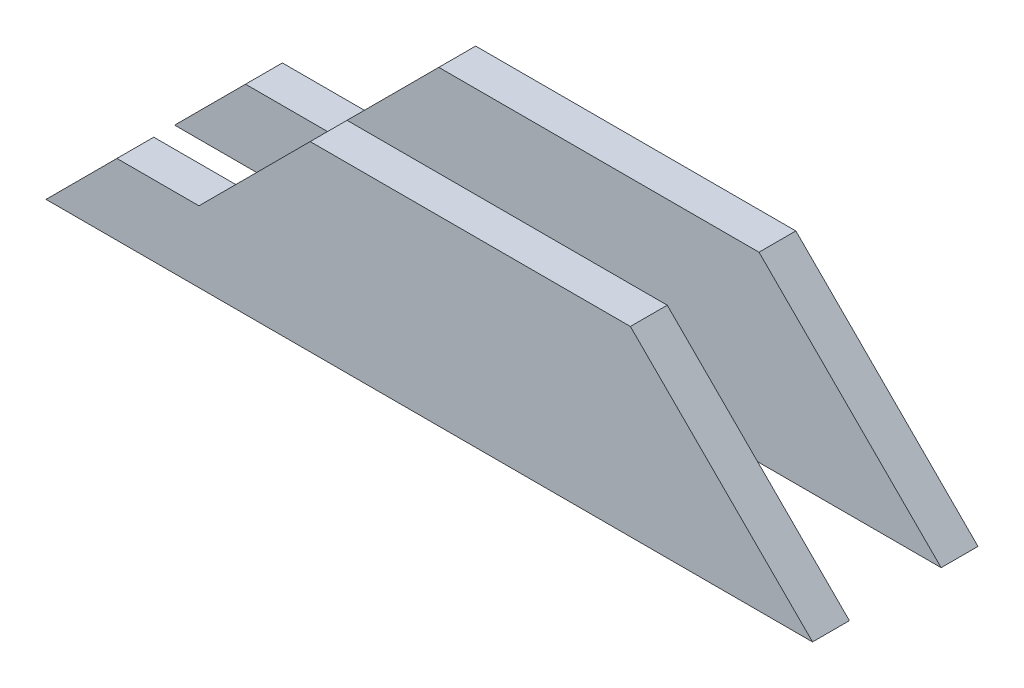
ISO-10303-21;
HEADER;
FILE_DESCRIPTION(('STEP AP214'),'2;1');
FILE_NAME('part.step','',(''),(''),'','','');
FILE_SCHEMA(('AUTOMOTIVE_DESIGN { 1 0 10303 214 1 1 1 1 }'));
ENDSEC;
DATA;
#1=APPLICATION_CONTEXT('core data for automotive mechanical design processes');
#2=APPLICATION_PROTOCOL_DEFINITION('international standard','automotive_design',2000,#1);
#3=PRODUCT_CONTEXT('',#1,'mechanical');
#4=PRODUCT('Part','Part','',(#3));
#5=PRODUCT_RELATED_PRODUCT_CATEGORY('part','',(#4));
#6=PRODUCT_DEFINITION_FORMATION('','',#4);
#7=PRODUCT_DEFINITION_CONTEXT('part definition',#1,'design');
#8=PRODUCT_DEFINITION('design','',#6,#7);
#9=PRODUCT_DEFINITION_SHAPE('','',#8);
#10=(LENGTH_UNIT() NAMED_UNIT(*) SI_UNIT(.MILLI.,.METRE.));
#11=(NAMED_UNIT(*) PLANE_ANGLE_UNIT() SI_UNIT($,.RADIAN.));
#12=(NAMED_UNIT(*) SI_UNIT($,.STERADIAN.) SOLID_ANGLE_UNIT());
#13=UNCERTAINTY_MEASURE_WITH_UNIT(LENGTH_MEASURE(1.E-05),#10,'distance_accuracy_value','');
#14=(GEOMETRIC_REPRESENTATION_CONTEXT(3) GLOBAL_UNCERTAINTY_ASSIGNED_CONTEXT((#13)) GLOBAL_UNIT_ASSIGNED_CONTEXT((#10,
#11,#12)) REPRESENTATION_CONTEXT('',''));
#15=CARTESIAN_POINT('',(0.,0.,0.));
#16=DIRECTION('',(0.,0.,1.));
#17=DIRECTION('',(1.,0.,0.));
#18=AXIS2_PLACEMENT_3D('',#15,#16,#17);
#19=CARTESIAN_POINT('',(-115.2652,12.954,15.113));
#20=DIRECTION('',(0.,1.,0.));
#21=DIRECTION('',(0.,0.,1.));
#22=AXIS2_PLACEMENT_3D('',#19,#20,#21);
#23=PLANE('',#22);
#24=DIRECTION('',(0.,0.,1.));
#25=VECTOR('',#24,1.);
#26=CARTESIAN_POINT('',(-102.3112,12.954,-15.11305));
#27=LINE('',#26,#25);
#28=CARTESIAN_POINT('',(-102.3112,12.954,-15.113));
#29=VERTEX_POINT('',#28);
#30=CARTESIAN_POINT('',(-102.3112,12.954,-8.382));
#31=VERTEX_POINT('',#30);
#32=EDGE_CURVE('E160',#29,#31,#27,.T.);
#33=ORIENTED_EDGE('',*,*,#32,.T.);
#34=DIRECTION('',(-1.,0.,0.));
#35=VECTOR('',#34,1.);
#36=CARTESIAN_POINT('',(-115.2652,12.954,-8.382));
#37=LINE('',#36,#35);
#38=CARTESIAN_POINT('',(-87.3252,12.954,-8.382));
#39=VERTEX_POINT('',#38);
#40=EDGE_CURVE('E53',#39,#31,#37,.T.);
#41=ORIENTED_EDGE('',*,*,#40,.F.);
#42=DIRECTION('',(0.,0.,-1.));
#43=VECTOR('',#42,1.);
#44=CARTESIAN_POINT('',(-87.3252,12.954,116.310275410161));
#45=LINE('',#44,#43);
#46=CARTESIAN_POINT('',(-87.3252,12.954,-15.113));
#47=VERTEX_POINT('',#46);
#48=EDGE_CURVE('E106',#39,#47,#45,.T.);
#49=ORIENTED_EDGE('',*,*,#48,.T.);
#50=DIRECTION('',(-1.,0.,0.));
#51=VECTOR('',#50,1.);
#52=CARTESIAN_POINT('',(-115.2652,12.954,-15.113));
#53=LINE('',#52,#51);
#54=EDGE_CURVE('E109',#47,#29,#53,.T.);
#55=ORIENTED_EDGE('',*,*,#54,.T.);
#56=EDGE_LOOP('',(#33,#41,#49,#55));
#57=FACE_BOUND('',#56,.T.);
#58=ADVANCED_FACE('F44',(#57),#23,.T.);
#59=CARTESIAN_POINT('',(-115.2652,0.,15.113));
#60=DIRECTION('',(0.,1.,0.));
#61=DIRECTION('',(0.,0.,1.));
#62=AXIS2_PLACEMENT_3D('',#59,#60,#61);
#63=PLANE('',#62);
#64=DIRECTION('',(0.,0.,-1.));
#65=VECTOR('',#64,1.);
#66=CARTESIAN_POINT('',(24.765,0.,-15.113));
#67=LINE('',#66,#65);
#68=CARTESIAN_POINT('',(24.765,0.,-8.382));
#69=VERTEX_POINT('',#68);
#70=CARTESIAN_POINT('',(24.765,0.,-15.113));
#71=VERTEX_POINT('',#70);
#72=EDGE_CURVE('E130',#69,#71,#67,.T.);
#73=ORIENTED_EDGE('',*,*,#72,.F.);
#74=DIRECTION('',(-1.,0.,0.));
#75=VECTOR('',#74,1.);
#76=CARTESIAN_POINT('',(-115.2652,0.,-8.382));
#77=LINE('',#76,#75);
#78=CARTESIAN_POINT('',(-115.2652,0.,-8.382));
#79=VERTEX_POINT('',#78);
#80=EDGE_CURVE('E78',#69,#79,#77,.T.);
#81=ORIENTED_EDGE('',*,*,#80,.T.);
#82=DIRECTION('',(0.,0.,1.));
#83=VECTOR('',#82,1.);
#84=CARTESIAN_POINT('',(-115.2652,0.,-15.113));
#85=LINE('',#84,#83);
#86=CARTESIAN_POINT('',(-115.2652,0.,-15.113));
#87=VERTEX_POINT('',#86);
#88=EDGE_CURVE('E102',#87,#79,#85,.T.);
#89=ORIENTED_EDGE('',*,*,#88,.F.);
#90=DIRECTION('',(-1.,0.,0.));
#91=VECTOR('',#90,1.);
#92=CARTESIAN_POINT('',(-115.2652,0.,-15.113));
#93=LINE('',#92,#91);
#94=EDGE_CURVE('E83',#71,#87,#93,.T.);
#95=ORIENTED_EDGE('',*,*,#94,.F.);
#96=EDGE_LOOP('',(#73,#81,#89,#95));
#97=FACE_BOUND('',#96,.T.);
#98=ADVANCED_FACE('F46',(#97),#63,.F.);
#99=CARTESIAN_POINT('',(-67.0051999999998,33.274,116.310275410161));
#100=DIRECTION('',(0.707106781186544,-0.707106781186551,0.));
#101=DIRECTION('',(0.707106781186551,0.707106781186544,0.));
#102=AXIS2_PLACEMENT_3D('',#99,#100,#101);
#103=PLANE('',#102);
#104=ORIENTED_EDGE('',*,*,#48,.F.);
#105=DIRECTION('',(0.707106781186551,0.707106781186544,0.));
#106=VECTOR('',#105,1.);
#107=CARTESIAN_POINT('',(-67.0051999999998,33.274,-8.382));
#108=LINE('',#107,#106);
#109=CARTESIAN_POINT('',(-67.0051999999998,33.274,-8.382));
#110=VERTEX_POINT('',#109);
#111=EDGE_CURVE('E60',#39,#110,#108,.T.);
#112=ORIENTED_EDGE('',*,*,#111,.T.);
#113=DIRECTION('',(0.,0.,-1.));
#114=VECTOR('',#113,1.);
#115=CARTESIAN_POINT('',(-67.0051999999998,33.274,116.310275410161));
#116=LINE('',#115,#114);
#117=CARTESIAN_POINT('',(-67.0051999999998,33.274,-15.113));
#118=VERTEX_POINT('',#117);
#119=EDGE_CURVE('E93',#110,#118,#116,.T.);
#120=ORIENTED_EDGE('',*,*,#119,.T.);
#121=DIRECTION('',(0.707106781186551,0.707106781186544,0.));
#122=VECTOR('',#121,1.);
#123=CARTESIAN_POINT('',(-67.0051999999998,33.274,-15.113));
#124=LINE('',#123,#122);
#125=EDGE_CURVE('E119',#47,#118,#124,.T.);
#126=ORIENTED_EDGE('',*,*,#125,.F.);
#127=EDGE_LOOP('',(#104,#112,#120,#126));
#128=FACE_BOUND('',#127,.T.);
#129=ADVANCED_FACE('F154',(#128),#103,.F.);
#130=CARTESIAN_POINT('',(-8.50900000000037,33.274,116.310275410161));
#131=DIRECTION('',(0.,-1.,0.));
#132=DIRECTION('',(1.,0.,0.));
#133=AXIS2_PLACEMENT_3D('',#130,#131,#132);
#134=PLANE('',#133);
#135=ORIENTED_EDGE('',*,*,#119,.F.);
#136=DIRECTION('',(1.,0.,0.));
#137=VECTOR('',#136,1.);
#138=CARTESIAN_POINT('',(-115.265225,33.274,-8.382));
#139=LINE('',#138,#137);
#140=CARTESIAN_POINT('',(-8.50900000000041,33.274,-8.382));
#141=VERTEX_POINT('',#140);
#142=EDGE_CURVE('E75',#110,#141,#139,.T.);
#143=ORIENTED_EDGE('',*,*,#142,.T.);
#144=DIRECTION('',(0.,0.,-1.));
#145=VECTOR('',#144,1.);
#146=CARTESIAN_POINT('',(-8.50900000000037,33.274,116.310275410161));
#147=LINE('',#146,#145);
#148=CARTESIAN_POINT('',(-8.50900000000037,33.274,-15.113));
#149=VERTEX_POINT('',#148);
#150=EDGE_CURVE('E84',#141,#149,#147,.T.);
#151=ORIENTED_EDGE('',*,*,#150,.T.);
#152=DIRECTION('',(1.,0.,0.));
#153=VECTOR('',#152,1.);
#154=CARTESIAN_POINT('',(-8.50900000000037,33.274,-15.113));
#155=LINE('',#154,#153);
#156=EDGE_CURVE('E116',#118,#149,#155,.T.);
#157=ORIENTED_EDGE('',*,*,#156,.F.);
#158=EDGE_LOOP('',(#135,#143,#151,#157));
#159=FACE_BOUND('',#158,.T.);
#160=ADVANCED_FACE('F89',(#159),#134,.F.);
#161=CARTESIAN_POINT('',(11.8109999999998,12.954,116.310275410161));
#162=DIRECTION('',(-0.707106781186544,-0.707106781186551,0.));
#163=DIRECTION('',(0.707106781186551,-0.707106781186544,0.));
#164=AXIS2_PLACEMENT_3D('',#161,#162,#163);
#165=PLANE('',#164);
#166=ORIENTED_EDGE('',*,*,#150,.F.);
#167=DIRECTION('',(0.707106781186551,-0.707106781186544,0.));
#168=VECTOR('',#167,1.);
#169=CARTESIAN_POINT('',(11.8109999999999,12.954,-8.382));
#170=LINE('',#169,#168);
#171=EDGE_CURVE('E72',#141,#69,#170,.T.);
#172=ORIENTED_EDGE('',*,*,#171,.T.);
#173=ORIENTED_EDGE('',*,*,#72,.T.);
#174=DIRECTION('',(0.707106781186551,-0.707106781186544,0.));
#175=VECTOR('',#174,1.);
#176=CARTESIAN_POINT('',(11.8109999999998,12.954,-15.113));
#177=LINE('',#176,#175);
#178=EDGE_CURVE('E98',#149,#71,#177,.T.);
#179=ORIENTED_EDGE('',*,*,#178,.F.);
#180=EDGE_LOOP('',(#166,#172,#173,#179));
#181=FACE_BOUND('',#180,.T.);
#182=ADVANCED_FACE('F96',(#181),#165,.F.);
#183=CARTESIAN_POINT('',(-115.2652,12.954,-15.113));
#184=DIRECTION('',(0.,0.,1.));
#185=DIRECTION('',(1.,0.,0.));
#186=AXIS2_PLACEMENT_3D('',#183,#184,#185);
#187=PLANE('',#186);
#188=ORIENTED_EDGE('',*,*,#178,.T.);
#189=ORIENTED_EDGE('',*,*,#94,.T.);
#190=DIRECTION('',(0.707106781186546,0.707106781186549,0.));
#191=VECTOR('',#190,1.);
#192=CARTESIAN_POINT('',(-108.7882,6.47700000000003,-15.113));
#193=LINE('',#192,#191);
#194=EDGE_CURVE('E110',#87,#29,#193,.T.);
#195=ORIENTED_EDGE('',*,*,#194,.T.);
#196=ORIENTED_EDGE('',*,*,#54,.F.);
#197=ORIENTED_EDGE('',*,*,#125,.T.);
#198=ORIENTED_EDGE('',*,*,#156,.T.);
#199=EDGE_LOOP('',(#188,#189,#195,#196,#197,#198));
#200=FACE_BOUND('',#199,.T.);
#201=ADVANCED_FACE('F157',(#200),#187,.F.);
#202=CARTESIAN_POINT('',(-115.265225,-8.44711918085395,-8.382));
#203=DIRECTION('',(0.,0.,-1.));
#204=DIRECTION('',(0.,1.,0.));
#205=AXIS2_PLACEMENT_3D('',#202,#203,#204);
#206=PLANE('',#205);
#207=ORIENTED_EDGE('',*,*,#80,.F.);
#208=ORIENTED_EDGE('',*,*,#171,.F.);
#209=ORIENTED_EDGE('',*,*,#142,.F.);
#210=ORIENTED_EDGE('',*,*,#111,.F.);
#211=ORIENTED_EDGE('',*,*,#40,.T.);
#212=DIRECTION('',(-0.707106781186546,-0.707106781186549,0.));
#213=VECTOR('',#212,1.);
#214=CARTESIAN_POINT('',(-119.488772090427,-4.22357209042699,-8.382));
#215=LINE('',#214,#213);
#216=EDGE_CURVE('E12',#31,#79,#215,.T.);
#217=ORIENTED_EDGE('',*,*,#216,.T.);
#218=EDGE_LOOP('',(#207,#208,#209,#210,#211,#217));
#219=FACE_BOUND('',#218,.T.);
#220=ADVANCED_FACE('F74',(#219),#206,.F.);
#221=CARTESIAN_POINT('',(-115.2652,0.,-15.11305));
#222=DIRECTION('',(0.707106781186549,-0.707106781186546,0.));
#223=DIRECTION('',(0.707106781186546,0.707106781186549,0.));
#224=AXIS2_PLACEMENT_3D('',#221,#222,#223);
#225=PLANE('',#224);
#226=ORIENTED_EDGE('',*,*,#88,.T.);
#227=ORIENTED_EDGE('',*,*,#216,.F.);
#228=ORIENTED_EDGE('',*,*,#32,.F.);
#229=ORIENTED_EDGE('',*,*,#194,.F.);
#230=EDGE_LOOP('',(#226,#227,#228,#229));
#231=FACE_BOUND('',#230,.T.);
#232=ADVANCED_FACE('F137',(#231),#225,.F.);
#233=CLOSED_SHELL('',(#58,#98,#129,#160,#182,#201,#220,#232));
#234=MANIFOLD_SOLID_BREP('B2',#233);
#235=CARTESIAN_POINT('',(-115.2652,12.954,15.113));
#236=DIRECTION('',(0.,0.,-1.));
#237=DIRECTION('',(-1.,0.,0.));
#238=AXIS2_PLACEMENT_3D('',#235,#236,#237);
#239=PLANE('',#238);
#240=DIRECTION('',(1.,0.,0.));
#241=VECTOR('',#240,1.);
#242=CARTESIAN_POINT('',(-115.2652,0.,15.113));
#243=LINE('',#242,#241);
#244=CARTESIAN_POINT('',(-115.2652,0.,15.113));
#245=VERTEX_POINT('',#244);
#246=CARTESIAN_POINT('',(24.765,0.,15.113));
#247=VERTEX_POINT('',#246);
#248=EDGE_CURVE('E306',#245,#247,#243,.T.);
#249=ORIENTED_EDGE('',*,*,#248,.T.);
#250=DIRECTION('',(0.707106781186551,-0.707106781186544,0.));
#251=VECTOR('',#250,1.);
#252=CARTESIAN_POINT('',(11.8109999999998,12.954,15.113));
#253=LINE('',#252,#251);
#254=CARTESIAN_POINT('',(-8.50900000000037,33.274,15.113));
#255=VERTEX_POINT('',#254);
#256=EDGE_CURVE('E330',#255,#247,#253,.T.);
#257=ORIENTED_EDGE('',*,*,#256,.F.);
#258=DIRECTION('',(1.,0.,0.));
#259=VECTOR('',#258,1.);
#260=CARTESIAN_POINT('',(-8.5090000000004,33.274,15.113));
#261=LINE('',#260,#259);
#262=CARTESIAN_POINT('',(-67.0051999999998,33.274,15.113));
#263=VERTEX_POINT('',#262);
#264=EDGE_CURVE('E323',#263,#255,#261,.T.);
#265=ORIENTED_EDGE('',*,*,#264,.F.);
#266=DIRECTION('',(0.707106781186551,0.707106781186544,0.));
#267=VECTOR('',#266,1.);
#268=CARTESIAN_POINT('',(-67.0051999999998,33.274,15.113));
#269=LINE('',#268,#267);
#270=CARTESIAN_POINT('',(-87.3252,12.954,15.113));
#271=VERTEX_POINT('',#270);
#272=EDGE_CURVE('E301',#271,#263,#269,.T.);
#273=ORIENTED_EDGE('',*,*,#272,.F.);
#274=DIRECTION('',(1.,0.,0.));
#275=VECTOR('',#274,1.);
#276=CARTESIAN_POINT('',(-115.2652,12.954,15.113));
#277=LINE('',#276,#275);
#278=CARTESIAN_POINT('',(-102.3112,12.954,15.113));
#279=VERTEX_POINT('',#278);
#280=EDGE_CURVE('E236',#279,#271,#277,.T.);
#281=ORIENTED_EDGE('',*,*,#280,.F.);
#282=DIRECTION('',(-0.707106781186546,-0.707106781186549,0.));
#283=VECTOR('',#282,1.);
#284=CARTESIAN_POINT('',(-108.7882,6.47700000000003,15.113));
#285=LINE('',#284,#283);
#286=EDGE_CURVE('E284',#279,#245,#285,.T.);
#287=ORIENTED_EDGE('',*,*,#286,.T.);
#288=EDGE_LOOP('',(#249,#257,#265,#273,#281,#287));
#289=FACE_BOUND('',#288,.T.);
#290=ADVANCED_FACE('F233',(#289),#239,.F.);
#291=CARTESIAN_POINT('',(11.8109999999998,12.954,116.310275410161));
#292=DIRECTION('',(-0.707106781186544,-0.707106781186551,0.));
#293=DIRECTION('',(0.707106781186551,-0.707106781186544,0.));
#294=AXIS2_PLACEMENT_3D('',#291,#292,#293);
#295=PLANE('',#294);
#296=ORIENTED_EDGE('',*,*,#256,.T.);
#297=DIRECTION('',(0.,0.,-1.));
#298=VECTOR('',#297,1.);
#299=CARTESIAN_POINT('',(24.765,0.,-15.113));
#300=LINE('',#299,#298);
#301=CARTESIAN_POINT('',(24.765,0.,8.382));
#302=VERTEX_POINT('',#301);
#303=EDGE_CURVE('E303',#247,#302,#300,.T.);
#304=ORIENTED_EDGE('',*,*,#303,.T.);
#305=DIRECTION('',(-0.707106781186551,0.707106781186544,0.));
#306=VECTOR('',#305,1.);
#307=CARTESIAN_POINT('',(11.8109999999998,12.954,8.382));
#308=LINE('',#307,#306);
#309=CARTESIAN_POINT('',(-8.50900000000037,33.274,8.38200000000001));
#310=VERTEX_POINT('',#309);
#311=EDGE_CURVE('E242',#302,#310,#308,.T.);
#312=ORIENTED_EDGE('',*,*,#311,.T.);
#313=DIRECTION('',(0.,0.,-1.));
#314=VECTOR('',#313,1.);
#315=CARTESIAN_POINT('',(-8.50900000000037,33.274,116.310275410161));
#316=LINE('',#315,#314);
#317=EDGE_CURVE('E327',#255,#310,#316,.T.);
#318=ORIENTED_EDGE('',*,*,#317,.F.);
#319=EDGE_LOOP('',(#296,#304,#312,#318));
#320=FACE_BOUND('',#319,.T.);
#321=ADVANCED_FACE('F350',(#320),#295,.F.);
#322=CARTESIAN_POINT('',(-8.50900000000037,33.274,116.310275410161));
#323=DIRECTION('',(0.,-1.,0.));
#324=DIRECTION('',(1.,0.,0.));
#325=AXIS2_PLACEMENT_3D('',#322,#323,#324);
#326=PLANE('',#325);
#327=ORIENTED_EDGE('',*,*,#317,.T.);
#328=DIRECTION('',(1.,0.,0.));
#329=VECTOR('',#328,1.);
#330=CARTESIAN_POINT('',(-115.265225,33.274,8.38200000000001));
#331=LINE('',#330,#329);
#332=CARTESIAN_POINT('',(-67.0051999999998,33.274,8.38200000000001));
#333=VERTEX_POINT('',#332);
#334=EDGE_CURVE('E256',#333,#310,#331,.T.);
#335=ORIENTED_EDGE('',*,*,#334,.F.);
#336=DIRECTION('',(0.,0.,-1.));
#337=VECTOR('',#336,1.);
#338=CARTESIAN_POINT('',(-67.0051999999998,33.274,116.310275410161));
#339=LINE('',#338,#337);
#340=EDGE_CURVE('E317',#263,#333,#339,.T.);
#341=ORIENTED_EDGE('',*,*,#340,.F.);
#342=ORIENTED_EDGE('',*,*,#264,.T.);
#343=EDGE_LOOP('',(#327,#335,#341,#342));
#344=FACE_BOUND('',#343,.T.);
#345=ADVANCED_FACE('F351',(#344),#326,.F.);
#346=CARTESIAN_POINT('',(-67.0051999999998,33.274,116.310275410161));
#347=DIRECTION('',(0.707106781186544,-0.707106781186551,0.));
#348=DIRECTION('',(0.707106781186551,0.707106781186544,0.));
#349=AXIS2_PLACEMENT_3D('',#346,#347,#348);
#350=PLANE('',#349);
#351=ORIENTED_EDGE('',*,*,#340,.T.);
#352=DIRECTION('',(-0.707106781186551,-0.707106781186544,0.));
#353=VECTOR('',#352,1.);
#354=CARTESIAN_POINT('',(-67.0051999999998,33.274,8.38200000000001));
#355=LINE('',#354,#353);
#356=CARTESIAN_POINT('',(-87.3252,12.954,8.382));
#357=VERTEX_POINT('',#356);
#358=EDGE_CURVE('E318',#333,#357,#355,.T.);
#359=ORIENTED_EDGE('',*,*,#358,.T.);
#360=DIRECTION('',(0.,0.,-1.));
#361=VECTOR('',#360,1.);
#362=CARTESIAN_POINT('',(-87.3252,12.954,116.310275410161));
#363=LINE('',#362,#361);
#364=EDGE_CURVE('E314',#271,#357,#363,.T.);
#365=ORIENTED_EDGE('',*,*,#364,.F.);
#366=ORIENTED_EDGE('',*,*,#272,.T.);
#367=EDGE_LOOP('',(#351,#359,#365,#366));
#368=FACE_BOUND('',#367,.T.);
#369=ADVANCED_FACE('F340',(#368),#350,.F.);
#370=CARTESIAN_POINT('',(-115.2652,0.,15.113));
#371=DIRECTION('',(0.,1.,0.));
#372=DIRECTION('',(0.,0.,1.));
#373=AXIS2_PLACEMENT_3D('',#370,#371,#372);
#374=PLANE('',#373);
#375=DIRECTION('',(0.,0.,1.));
#376=VECTOR('',#375,1.);
#377=CARTESIAN_POINT('',(-115.2652,0.,-15.113));
#378=LINE('',#377,#376);
#379=CARTESIAN_POINT('',(-115.2652,0.,8.382));
#380=VERTEX_POINT('',#379);
#381=EDGE_CURVE('E287',#380,#245,#378,.T.);
#382=ORIENTED_EDGE('',*,*,#381,.F.);
#383=DIRECTION('',(1.,0.,0.));
#384=VECTOR('',#383,1.);
#385=CARTESIAN_POINT('',(-115.2652,0.,8.382));
#386=LINE('',#385,#384);
#387=EDGE_CURVE('E342',#380,#302,#386,.T.);
#388=ORIENTED_EDGE('',*,*,#387,.T.);
#389=ORIENTED_EDGE('',*,*,#303,.F.);
#390=ORIENTED_EDGE('',*,*,#248,.F.);
#391=EDGE_LOOP('',(#382,#388,#389,#390));
#392=FACE_BOUND('',#391,.T.);
#393=ADVANCED_FACE('F348',(#392),#374,.F.);
#394=CARTESIAN_POINT('',(-115.2652,12.954,15.113));
#395=DIRECTION('',(0.,1.,0.));
#396=DIRECTION('',(0.,0.,1.));
#397=AXIS2_PLACEMENT_3D('',#394,#395,#396);
#398=PLANE('',#397);
#399=DIRECTION('',(0.,0.,1.));
#400=VECTOR('',#399,1.);
#401=CARTESIAN_POINT('',(-102.3112,12.954,-15.11305));
#402=LINE('',#401,#400);
#403=CARTESIAN_POINT('',(-102.3112,12.954,8.382));
#404=VERTEX_POINT('',#403);
#405=EDGE_CURVE('E249',#404,#279,#402,.T.);
#406=ORIENTED_EDGE('',*,*,#405,.T.);
#407=ORIENTED_EDGE('',*,*,#280,.T.);
#408=ORIENTED_EDGE('',*,*,#364,.T.);
#409=DIRECTION('',(1.,0.,0.));
#410=VECTOR('',#409,1.);
#411=CARTESIAN_POINT('',(-115.2652,12.954,8.382));
#412=LINE('',#411,#410);
#413=EDGE_CURVE('E298',#404,#357,#412,.T.);
#414=ORIENTED_EDGE('',*,*,#413,.F.);
#415=EDGE_LOOP('',(#406,#407,#408,#414));
#416=FACE_BOUND('',#415,.T.);
#417=ADVANCED_FACE('F295',(#416),#398,.T.);
#418=CARTESIAN_POINT('',(-115.265225,-8.44711918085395,8.382));
#419=DIRECTION('',(0.,0.,1.));
#420=DIRECTION('',(0.,-1.,0.));
#421=AXIS2_PLACEMENT_3D('',#418,#419,#420);
#422=PLANE('',#421);
#423=ORIENTED_EDGE('',*,*,#311,.F.);
#424=ORIENTED_EDGE('',*,*,#387,.F.);
#425=DIRECTION('',(0.707106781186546,0.707106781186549,0.));
#426=VECTOR('',#425,1.);
#427=CARTESIAN_POINT('',(-119.488772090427,-4.22357209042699,8.382));
#428=LINE('',#427,#426);
#429=EDGE_CURVE('E42',#380,#404,#428,.T.);
#430=ORIENTED_EDGE('',*,*,#429,.T.);
#431=ORIENTED_EDGE('',*,*,#413,.T.);
#432=ORIENTED_EDGE('',*,*,#358,.F.);
#433=ORIENTED_EDGE('',*,*,#334,.T.);
#434=EDGE_LOOP('',(#423,#424,#430,#431,#432,#433));
#435=FACE_BOUND('',#434,.T.);
#436=ADVANCED_FACE('F349',(#435),#422,.F.);
#437=CARTESIAN_POINT('',(-115.2652,0.,-15.11305));
#438=DIRECTION('',(0.707106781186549,-0.707106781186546,0.));
#439=DIRECTION('',(0.707106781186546,0.707106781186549,0.));
#440=AXIS2_PLACEMENT_3D('',#437,#438,#439);
#441=PLANE('',#440);
#442=ORIENTED_EDGE('',*,*,#405,.F.);
#443=ORIENTED_EDGE('',*,*,#429,.F.);
#444=ORIENTED_EDGE('',*,*,#381,.T.);
#445=ORIENTED_EDGE('',*,*,#286,.F.);
#446=EDGE_LOOP('',(#442,#443,#444,#445));
#447=FACE_BOUND('',#446,.T.);
#448=ADVANCED_FACE('F285',(#447),#441,.F.);
#449=CLOSED_SHELL('',(#290,#321,#345,#369,#393,#417,#436,#448));
#450=MANIFOLD_SOLID_BREP('B6',#449);
#451=ADVANCED_BREP_SHAPE_REPRESENTATION('',(#18,#234,#450),#14);
#452=SHAPE_DEFINITION_REPRESENTATION(#9,#451);
ENDSEC;
END-ISO-10303-21;
